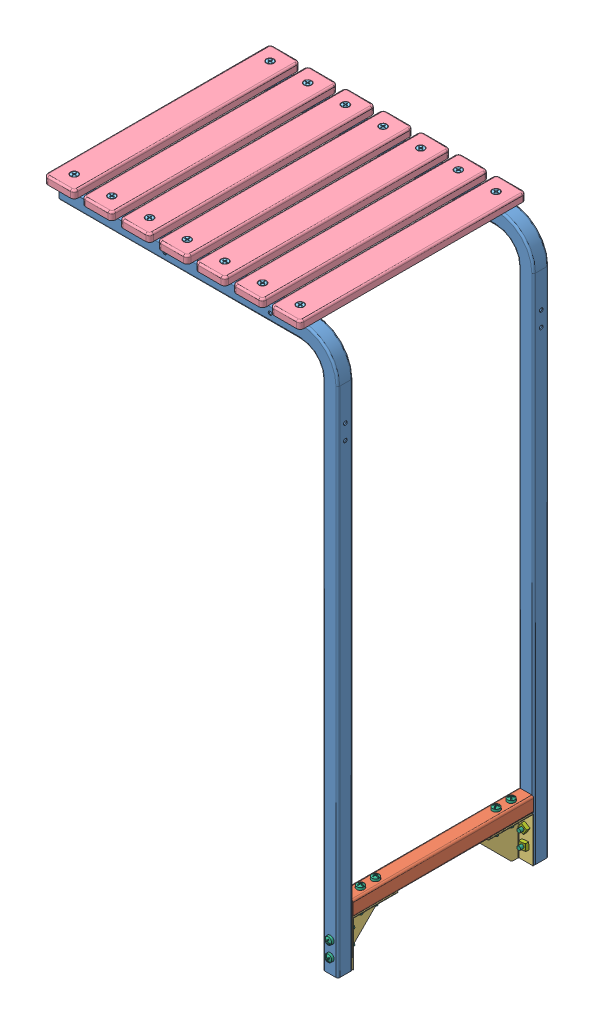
SolidWorks assembly Support_Frame_&.SLDASM, configuration Default (file format 15000). Lengths in mm.
Overall size (482.6 939.86 381).
43 component instances, 7 part files, 47 mates.
Components (placement in the parent):
- Support_Leg_&-1: Support_Leg_&.SLDPRT [Long Arm] at origin size (469.9 927.1 25.4)
- Support_Leg_&-2: Support_Leg_&.SLDPRT [Long Arm] at (0 0 -330.2) size (469.9 927.1 25.4)
- Lower_Brace_&-1: Lower_Brace_&.SLDASM [Default] at (457.2 -798.1188 -165.1) size (25.4 101.6 304.8)
  - Brace_Cross_Bar_&-1: Brace_Cross_Bar_&.SLDPRT [Plain] at (0 -27.3812 0) size (25.4 25.4 304.8)
  - Brace_Corner_&-1: Brace_Corner_&.SLDPRT [Default] at (-12.7 -40.0812 152.4) x (0 0 -1) z (1 0 0) size (76.2 76.2 25.4)
  - Brace_Corner_&-2: Brace_Corner_&.SLDPRT [Default] at (-12.7 -40.0812 -152.4) x (0 -1 0) z (1 0 0) size (76.2 76.2 25.4)
- Plank_&-15: Plank_&.SLDPRT [mahogony] at (12.7 12.7 -165.1) x (1 0 0) z (0 1 0) size (50.8 381 12.7)
- Plank_&-16: Plank_&.SLDPRT [mahogony] at (76.2 12.7 -165.1) x (1 0 0) z (0 1 0) size (50.8 381 12.7)
- Plank_&-17: Plank_&.SLDPRT [mahogony] at (139.7 12.7 -165.1) x (1 0 0) z (0 1 0) size (50.8 381 12.7)
- Plank_&-18: Plank_&.SLDPRT [mahogony] at (203.2 12.7 -165.1) x (1 0 0) z (0 1 0) size (50.8 381 12.7)
- Plank_&-19: Plank_&.SLDPRT [mahogony] at (266.7 12.7 -165.1) x (1 0 0) z (0 1 0) size (50.8 381 12.7)
- Plank_&-20: Plank_&.SLDPRT [mahogony] at (330.2 12.7 -165.1) x (1 0 0) z (0 1 0) size (50.8 381 12.7)
- Plank_&-21: Plank_&.SLDPRT [mahogony] at (393.7 12.7 -165.1) x (1 0 0) z (0 1 0) size (50.8 381 12.7)
- Flat Head Screw_&-1: Flat Head Screw_&.SLDPRT [1] at (12.7 25.4553 0) x (0 -1 0) z (0 0 1) size (19.05 11.23 11.23)
- Flat Head Screw_&-9: Flat Head Screw_&.SLDPRT [1] at (12.7 25.4553 -330.2) x (0 -1 0) z (0 0 1) size (19.05 11.23 11.23)
- Flat Head Screw_&-3: Flat Head Screw_&.SLDPRT [1] at (76.2 25.4553 0) x (0 -1 0) z (0 0 1) size (19.05 11.23 11.23)
- Flat Head Screw_&-4: Flat Head Screw_&.SLDPRT [1] at (139.7 25.4553 0) x (0 -1 0) z (0 0 1) size (19.05 11.23 11.23)
- Flat Head Screw_&-5: Flat Head Screw_&.SLDPRT [1] at (203.2 25.4553 0) x (0 -1 0) z (0 0 1) size (19.05 11.23 11.23)
- Flat Head Screw_&-6: Flat Head Screw_&.SLDPRT [1] at (266.7 25.4553 0) x (0 -1 0) z (0 0 1) size (19.05 11.23 11.23)
- Flat Head Screw_&-7: Flat Head Screw_&.SLDPRT [1] at (330.2 25.4553 0) x (0 -1 0) z (0 0 1) size (19.05 11.23 11.23)
- Flat Head Screw_&-8: Flat Head Screw_&.SLDPRT [1] at (393.7 25.4553 0) x (0 -1 0) z (0 0 1) size (19.05 11.23 11.23)
- Flat Head Screw_&-10: Flat Head Screw_&.SLDPRT [1] at (76.2 25.4553 -330.2) x (0 -1 0) z (0 0 1) size (19.05 11.23 11.23)
- Flat Head Screw_&-11: Flat Head Screw_&.SLDPRT [1] at (139.7 25.4553 -330.2) x (0 -1 0) z (0 0 1) size (19.05 11.23 11.23)
- Flat Head Screw_&-12: Flat Head Screw_&.SLDPRT [1] at (203.2 25.4553 -330.2) x (0 -1 0) z (0 0 1) size (19.05 11.23 11.23)
- Flat Head Screw_&-13: Flat Head Screw_&.SLDPRT [1] at (266.7 25.4553 -330.2) x (0 -1 0) z (0 0 1) size (19.05 11.23 11.23)
- Flat Head Screw_&-14: Flat Head Screw_&.SLDPRT [1] at (330.2 25.4553 -330.2) x (0 -1 0) z (0 0 1) size (19.05 11.23 11.23)
- Flat Head Screw_&-15: Flat Head Screw_&.SLDPRT [1] at (393.7 25.4553 -330.2) x (0 -1 0) z (0 0 1) size (19.05 11.23 11.23)
- Binding Head Screw_&-1: Binding Head Screw_&.SLDPRT [1] at (457.2 -806.6024 -38.1) x (0 -1 0) z (-0.995354 0 -0.096286) size (44.18 12.7 12.7)
- Square Nut_&-1: Square Nut_&.SLDPRT [1] at (457.2 -845.185 -38.1) x (0.9999 0 -0.014161) z (0 -1 0) size (15.73 15.73 5.97)
- Binding Head Screw_&-2: Binding Head Screw_&.SLDPRT [1] at (457.2 -806.6024 -63.5) x (0 -1 0) z (0.997911 0 0.064603) size (44.18 12.7 12.7)
- Square Nut_&-2: Square Nut_&.SLDPRT [1] at (457.2 -845.185 -63.5) x (-0.638951 0 0.769248) z (0 -1 0) size (15.73 15.73 5.97)
- Binding Head Screw_&-3: Binding Head Screw_&.SLDPRT [1] at (457.2 -863.6 18.8976) x (0 0 -1) z (-0.864559 0.502531 0) size (44.18 12.7 12.7)
- Binding Head Screw_&-4: Binding Head Screw_&.SLDPRT [1] at (457.2 -889 18.8976) x (0 0 -1) z (-0.551669 0.834063 0) size (44.18 12.7 12.7)
- Square Nut_&-3: Square Nut_&.SLDPRT [1] at (457.2 -863.6 -19.685) x (-0.998745 0.050081 0) z (0 0 -1) size (15.73 15.73 5.97)
- Square Nut_&-4: Square Nut_&.SLDPRT [1] at (457.2 -889 -19.685) x (0.458326 0.888784 0) z (0 0 -1) size (15.73 15.73 5.97)
- Binding Head Screw_&-5: Binding Head Screw_&.SLDPRT [1] at (457.2 -806.6024 -266.7) x (0 -1 0) z (-0.459324 0 -0.888269) size (44.18 12.7 12.7)
- Binding Head Screw_&-6: Binding Head Screw_&.SLDPRT [1] at (457.2 -806.6024 -292.1) x (0 -1 0) z (0.753871 0 0.657022) size (44.18 12.7 12.7)
- Binding Head Screw_&-7: Binding Head Screw_&.SLDPRT [1] at (457.2 -863.6 -349.0976) x (0 0 1) z (-0.999516 0.031099 0) size (44.18 12.7 12.7)
- Binding Head Screw_&-8: Binding Head Screw_&.SLDPRT [1] at (457.2 -889 -349.0976) x (0 0 1) z (0.68329 0.730147 0) size (44.18 12.7 12.7)
- Square Nut_&-5: Square Nut_&.SLDPRT [1] at (457.2 -845.185 -266.7) x (-0.502308 0 -0.864689) z (0 -1 0) size (15.73 15.73 5.97)
- Square Nut_&-6: Square Nut_&.SLDPRT [1] at (457.2 -845.185 -292.1) x (0.672374 0 -0.740212) z (0 -1 0) size (15.73 15.73 5.97)
- Square Nut_&-7: Square Nut_&.SLDPRT [1] at (457.2 -863.6 -310.515) x (-0.973807 -0.227375 0) z (0 0 1) size (15.73 15.73 5.97)
- Square Nut_&-8: Square Nut_&.SLDPRT [1] at (457.2 -889 -310.515) x (-0.758783 0.651343 0) z (0 0 1) size (15.73 15.73 5.97)
Mates (geometry in assembly coordinates):
- Coincident1: coincident aligned: plane of Support_Leg_&-1 through (469.9 -50.8 12.7) normal (1 0 0); plane of Support_Leg_&-2 through (469.9 -50.8 -317.5) normal (1 0 0)
- Coincident2: coincident aligned: plane of Support_Leg_&-1 through (406.4 12.7 12.7) normal (0 1 0); plane of Support_Leg_&-2 through (406.4 12.7 -317.5) normal (0 1 0)
- Perpendicular2: perpendicular: plane of Support_Leg_&-1 through (406.4 12.7 12.7) normal (0 0 1)
- Coincident15: coincident anti-aligned: plane of Support_Leg_&-1 through (406.4 12.7 12.7) normal (0 1 0); plane of Plank_&-15 through (38.1 12.7 -355.6) normal (0 -1 0)
- Concentric1: concentric aligned: cylinder of Support_Leg_&-1 through (12.7 -914.401 0) axis (0 1 0) radius 3.175; cylinder of Plank_&-15 through (12.7 25.4 0) axis (0 1 0) radius 3.3782
- Perpendicular1: perpendicular: plane of Support_Leg_&-1 through (406.4 12.7 12.7) normal (0 0 1); plane of Plank_&-15 through (38.1 25.4 25.4) normal (1 0 0)
- Coincident31: coincident aligned: plane of Support_Leg_&-1 through (469.9 -50.8 12.7) normal (1 0 0); plane of Lower_Brace_&-1/Brace_Cross_Bar_&-1 through (469.9 -838.2 -12.7) normal (1 0 0)
- Coincident32: coincident anti-aligned: plane of Support_Leg_&-1 through (406.4 -12.7 -12.7) normal (0 0 -1); plane of Lower_Brace_&-1/Brace_Cross_Bar_&-1 through (444.5 -838.2 -12.7) normal (0 0 1)
- Coincident33: coincident anti-aligned: plane of Support_Leg_&-2 through (406.4 12.7 -317.5) normal (0 0 1); plane of Lower_Brace_&-1/Brace_Cross_Bar_&-1 through (444.5 -838.2 -317.5) normal (0 0 -1)
- Coincident35: coincident anti-aligned: plane of Support_Leg_&-1 through (406.4 -12.7 -12.7) normal (0 0 -1); plane of Lower_Brace_&-1/Brace_Corner_&-1 through (469.9 -457.2 -12.7) normal (0 0 1)
- Concentric17: concentric anti-aligned: cylinder of Support_Leg_&-1 through (457.2 -863.6 12.7) axis (0 0 -1) radius 3.5719; cylinder of Lower_Brace_&-1/Brace_Corner_&-1 through (457.2 -863.6 -12.7) axis (0 0 1) radius 3.175
- Coincident37: coincident anti-aligned: plane of Support_Leg_&-2 through (406.4 12.7 -317.5) normal (0 0 1); plane of Lower_Brace_&-1/Brace_Corner_&-2 through (469.9 -914.4 -317.5) normal (0 0 -1)
- Concentric18: concentric aligned: cylinder of Support_Leg_&-2 through (457.2 -889 -317.5) axis (0 0 -1) radius 3.5719; cylinder of Lower_Brace_&-1/Brace_Corner_&-2 through (457.2 -889 -317.5) axis (0 0 -1) radius 3.175
- Coincident38: coincident aligned: cone of Plank_&-15 through (12.7 25.4 0) axis (0 -1 0); cone of Flat Head Screw_&-1 through (12.7 24.7073 0) axis (0 -1 0)
- Coincident39: coincident aligned: cone of Plank_&-15 through (12.7 25.4 -330.2) axis (0 -1 0); cone of Flat Head Screw_&-9 through (12.7 24.7073 -330.2) axis (0 -1 0)
- Concentric22: concentric anti-aligned: cylinder of Lower_Brace_&-1/Brace_Cross_Bar_&-1 through (457.2 -812.8 -38.1) axis (0 -1 0) radius 3.175; cylinder of Binding Head Screw_&-1 through (457.2 -781.2024 -38.1) axis (0 1 0) radius 3.175
- Coincident41: coincident anti-aligned: plane of Lower_Brace_&-1/Brace_Cross_Bar_&-1 through (444.5 -812.8 -12.7) normal (0 1 0); plane of Binding Head Screw_&-1 through (456.8943 -812.8 -34.9398) normal (0 -1 0)
- Concentric23: concentric anti-aligned: cylinder of Binding Head Screw_&-1 through (457.2 -781.2024 -38.1) axis (0 1 0) radius 3.175; cylinder of Square Nut_&-1 through (457.2 -839.216 -38.1) axis (0 -1 0) radius 2.5527
- Coincident42: coincident anti-aligned: plane of Lower_Brace_&-1/Brace_Corner_&-1 through (469.9 -839.216 -88.9) normal (0 -1 0); plane of Square Nut_&-1 through (457.0886 -839.216 -45.9659) normal (0 1 0)
- Concentric24: concentric anti-aligned: cylinder of Lower_Brace_&-1/Brace_Cross_Bar_&-1 through (457.2 -812.8 -63.5) axis (0 -1 0) radius 3.175; cylinder of Binding Head Screw_&-2 through (457.2 -781.2024 -63.5) axis (0 1 0) radius 3.175
- Coincident43: coincident anti-aligned: plane of Lower_Brace_&-1/Brace_Cross_Bar_&-1 through (444.5 -812.8 -12.7) normal (0 1 0); plane of Binding Head Screw_&-2 through (457.4051 -812.8 -66.6684) normal (0 -1 0)
- Concentric25: concentric anti-aligned: cylinder of Binding Head Screw_&-2 through (457.2 -781.2024 -63.5) axis (0 1 0) radius 3.175; cylinder of Square Nut_&-2 through (457.2 -839.216 -63.5) axis (0 -1 0) radius 2.5527
- Coincident44: coincident anti-aligned: plane of Lower_Brace_&-1/Brace_Corner_&-1 through (469.9 -839.216 -88.9) normal (0 -1 0); plane of Square Nut_&-2 through (463.2514 -839.216 -58.4736) normal (0 1 0)
- Concentric26: concentric anti-aligned: cylinder of Support_Leg_&-1 through (457.2 -863.6 12.7) axis (0 0 -1) radius 3.5719; cylinder of Binding Head Screw_&-3 through (457.2 -863.6 44.2976) axis (0 0 1) radius 3.175
- Coincident45: coincident anti-aligned: plane of Support_Leg_&-1 through (406.4 12.7 12.7) normal (0 0 1); plane of Binding Head Screw_&-3 through (455.6045 -866.345 12.7) normal (0 0 -1)
- Concentric27: concentric anti-aligned: cylinder of Support_Leg_&-1 through (457.2 -889 12.7) axis (0 0 -1) radius 3.5719; cylinder of Binding Head Screw_&-4 through (457.2 -889 44.2976) axis (0 0 1) radius 3.175
- Coincident46: coincident anti-aligned: plane of Support_Leg_&-1 through (406.4 12.7 12.7) normal (0 0 1); plane of Binding Head Screw_&-4 through (454.5518 -890.7515 12.7) normal (0 0 -1)
- Concentric28: concentric anti-aligned: cylinder of Binding Head Screw_&-4 through (457.2 -889 44.2976) axis (0 0 1) radius 3.175; cylinder of Square Nut_&-4 through (457.2 -889 5.3525) axis (0 0 -1) radius 3.175
- Coincident47: coincident anti-aligned: plane of Lower_Brace_&-1/Brace_Corner_&-1 through (469.9 -457.2 -13.716) normal (0 0 -1); plane of Square Nut_&-4 through (450.2082 -885.3945 -13.716) normal (0 0 1)
- Concentric29: concentric anti-aligned: cylinder of Binding Head Screw_&-3 through (457.2 -863.6 44.2976) axis (0 0 1) radius 3.175; cylinder of Square Nut_&-3 through (457.2 -863.6 5.3525) axis (0 0 -1) radius 3.175
- Coincident48: coincident anti-aligned: plane of Lower_Brace_&-1/Brace_Corner_&-1 through (469.9 -457.2 -13.716) normal (0 0 -1); plane of Square Nut_&-3 through (456.806 -871.4568 -13.716) normal (0 0 1)
- Concentric30: concentric anti-aligned: cylinder of Lower_Brace_&-1/Brace_Cross_Bar_&-1 through (457.2 -812.8 -266.7) axis (0 -1 0) radius 3.175; cylinder of Binding Head Screw_&-5 through (457.2 -781.2024 -266.7) axis (0 1 0) radius 3.175
- Coincident50: coincident anti-aligned: plane of Lower_Brace_&-1/Brace_Cross_Bar_&-1 through (444.5 -812.8 -12.7) normal (0 1 0); plane of Binding Head Screw_&-5 through (454.3797 -812.8 -265.2416) normal (0 -1 0)
- Concentric31: concentric anti-aligned: cylinder of Lower_Brace_&-1/Brace_Cross_Bar_&-1 through (457.2 -812.8 -292.1) axis (0 -1 0) radius 3.175; cylinder of Binding Head Screw_&-6 through (457.2 -781.2024 -292.1) axis (0 1 0) radius 3.175
- Coincident51: coincident anti-aligned: plane of Lower_Brace_&-1/Brace_Cross_Bar_&-1 through (444.5 -812.8 -12.7) normal (0 1 0); plane of Binding Head Screw_&-6 through (459.286 -812.8 -294.4935) normal (0 -1 0)
- Concentric32: concentric aligned: cylinder of Support_Leg_&-2 through (457.2 -863.6 -317.5) axis (0 0 -1) radius 3.5719; cylinder of Binding Head Screw_&-7 through (457.2 -863.6 -374.4976) axis (0 0 -1) radius 3.175
- Coincident52: coincident anti-aligned: plane of Support_Leg_&-2 through (406.4 -12.7 -342.9) normal (0 0 -1); plane of Binding Head Screw_&-7 through (457.2987 -860.4265 -342.9) normal (0 0 1)
- Concentric33: concentric aligned: cylinder of Support_Leg_&-2 through (457.2 -889 -317.5) axis (0 0 -1) radius 3.5719; cylinder of Binding Head Screw_&-8 through (457.2 -889 -374.4976) axis (0 0 -1) radius 3.175
- Coincident53: coincident anti-aligned: plane of Support_Leg_&-2 through (406.4 -12.7 -342.9) normal (0 0 -1); plane of Binding Head Screw_&-8 through (459.5182 -891.1694 -342.9) normal (0 0 1)
- Concentric34: concentric anti-aligned: cylinder of Binding Head Screw_&-5 through (457.2 -781.2024 -266.7) axis (0 1 0) radius 3.175; cylinder of Square Nut_&-5 through (457.2 -820.1475 -266.7) axis (0 -1 0) radius 3.175
- Coincident54: coincident anti-aligned: plane of Lower_Brace_&-1/Brace_Corner_&-2 through (469.9 -839.216 -698.5) normal (0 -1 0); plane of Square Nut_&-5 through (450.3977 -839.216 -262.7485) normal (0 1 0)
- Concentric35: concentric anti-aligned: cylinder of Binding Head Screw_&-6 through (457.2 -781.2024 -292.1) axis (0 1 0) radius 3.175; cylinder of Square Nut_&-6 through (457.2 -820.1475 -292.1) axis (0 -1 0) radius 3.175
- Coincident55: coincident anti-aligned: plane of Lower_Brace_&-1/Brace_Corner_&-2 through (469.9 -839.216 -698.5) normal (0 -1 0); plane of Square Nut_&-6 through (451.377 -839.216 -297.3894) normal (0 1 0)
- Concentric36: concentric anti-aligned: cylinder of Lower_Brace_&-1/Brace_Corner_&-2 through (457.2 -863.6 -317.5) axis (0 0 -1) radius 3.175; cylinder of Square Nut_&-7 through (457.2 -863.6 -335.5525) axis (0 0 1) radius 3.175
- Coincident56: coincident anti-aligned: plane of Lower_Brace_&-1/Brace_Corner_&-2 through (469.9 -914.4 -316.484) normal (0 0 1); plane of Square Nut_&-7 through (455.4113 -855.9393 -316.484) normal (0 0 -1)
- Concentric37: concentric anti-aligned: cylinder of Lower_Brace_&-1/Brace_Corner_&-2 through (457.2 -889 -317.5) axis (0 0 -1) radius 3.175; cylinder of Square Nut_&-8 through (457.2 -889 -335.5525) axis (0 0 1) radius 3.175
- Coincident57: coincident anti-aligned: plane of Lower_Brace_&-1/Brace_Corner_&-2 through (469.9 -914.4 -316.484) normal (0 0 1); plane of Square Nut_&-8 through (462.3239 -883.0309 -316.484) normal (0 0 -1)
